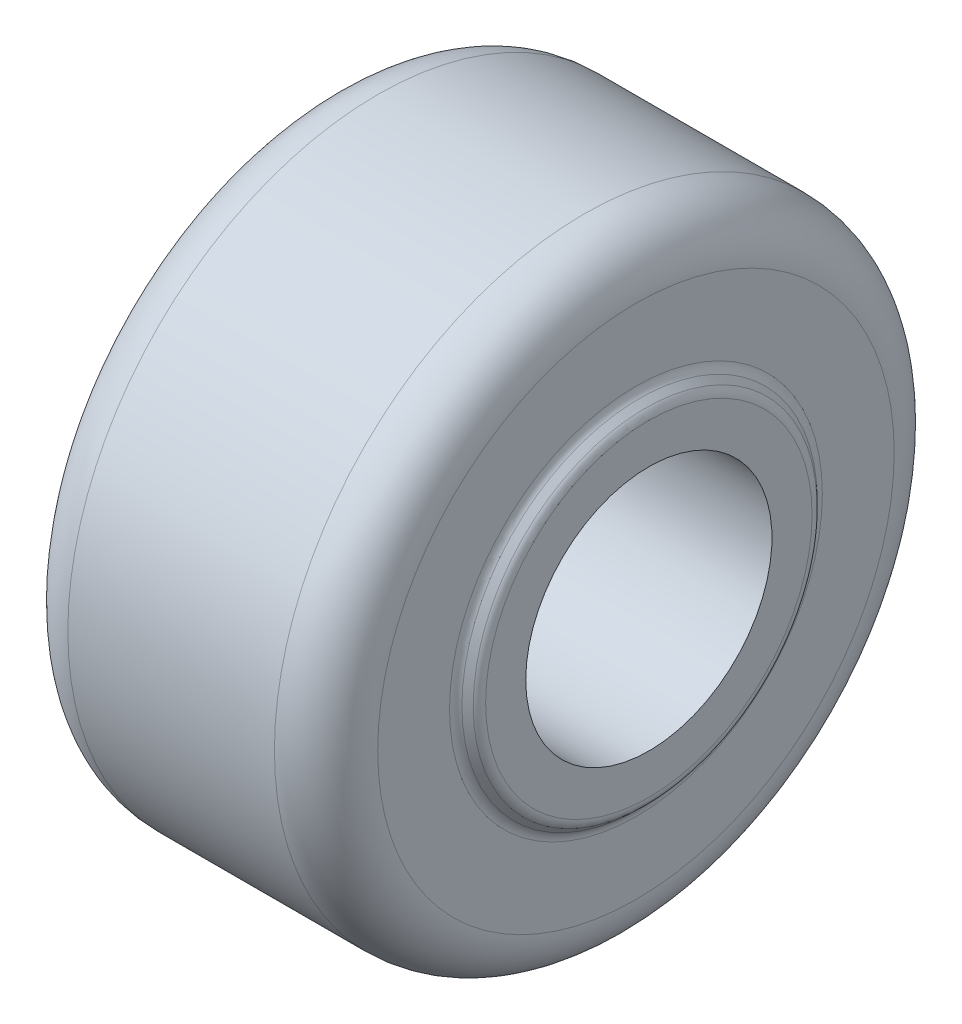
from build123d import *


with BuildPart() as part:
    # Sketch1 → Revolve1 (revolve)
    with BuildSketch(Plane.XY, mode=Mode.PRIVATE) as revolve1_sk:
        with BuildLine():
            Line((-20.6375, 15.1384), (20.6375, 15.1384))
            Line((20.6375, 15.1384), (20.6375, 20.069738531))
            ThreePointArc((20.6375, 20.069738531), (20.521492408, 20.652948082), (20.191130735, 21.147369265))
            Line((20.191130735, 21.147369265), (19.496369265, 21.842130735))
            ThreePointArc((19.496369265, 21.842130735), (19.166007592, 22.336551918), (19.05, 22.919761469))
            Line((19.05, 22.919761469), (19.05, 31.75))
            ThreePointArc((19.05, 31.75), (17.190128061, 36.240128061), (12.7, 38.1))
            Line((12.7, 38.1), (-12.7, 38.1))
            ThreePointArc((-12.7, 38.1), (-17.190128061, 36.240128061), (-19.05, 31.75))
            Line((-19.05, 31.75), (-19.05, 22.919761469))
            ThreePointArc((-19.05, 22.919761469), (-19.166007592, 22.336551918), (-19.496369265, 21.842130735))
            Line((-19.496369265, 21.842130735), (-20.191130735, 21.147369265))
            ThreePointArc((-20.191130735, 21.147369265), (-20.521492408, 20.652948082), (-20.6375, 20.069738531))
            Line((-20.6375, 20.069738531), (-20.6375, 15.1384))
        make_face()
    revolve(revolve1_sk.sketch.rotate(Axis((-38.862204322, 0, 0), (1, 0, 0)), 90), axis=Axis((-38.862204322, 0, 0), (1, 0, 0)))


solid = part.part
